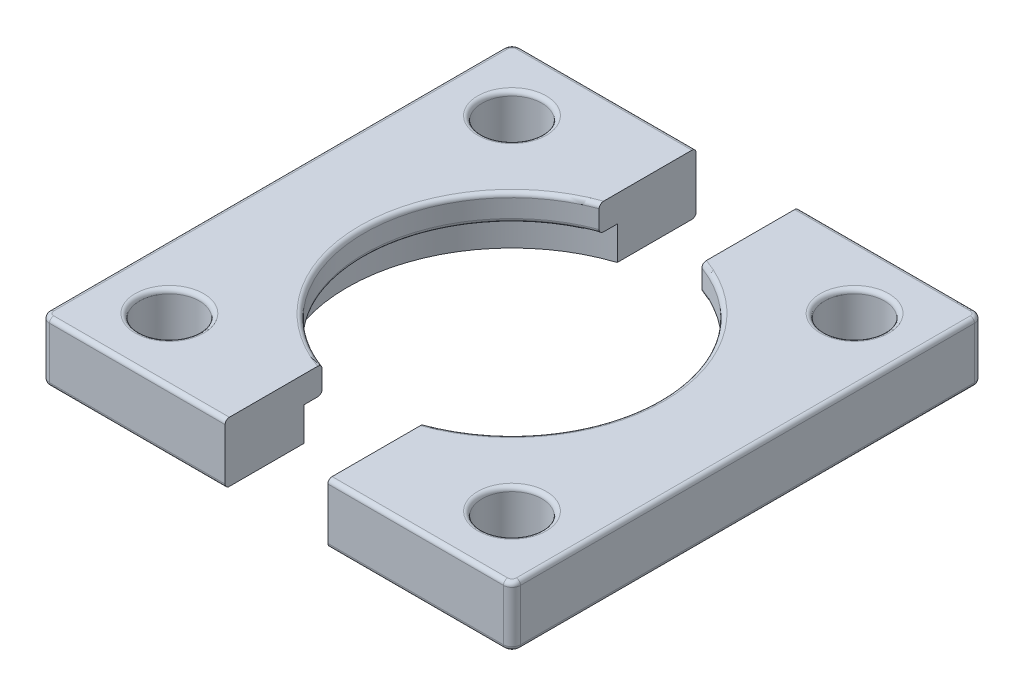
from build123d import *

# Parameters (mm, degrees)
SKETCH1_R             = 3.5
BOSS_EXTRUDE1_DEPTH   = 7
BOSS_EXTRUDE1_2_DEPTH = 7
SKETCH2_R             = 19.25
CUT_EXTRUDE1_DEPTH    = 3.9
FILLET1_R             = 0.5
FILLET2_R             = 0.5


with BuildPart() as part:
    # Sketch1 → Boss-Extrude1 (new body)
    with BuildSketch(Plane(origin=(0, 0, 0), x_dir=(1, 0, 0), z_dir=(0, 1, 0))):
        with BuildLine():
            Line((-6, 27.5), (-6, 16.17289399))
            ThreePointArc((-6, 16.17289399), (-17.25, 0), (-6, -16.17289399))
            Line((-6, -16.17289399), (-6, -27.5))
            Line((-6, -27.5), (-26.5, -27.5))
            ThreePointArc((-26.5, -27.5), (-27.207106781, -27.207106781), (-27.5, -26.5))
            Line((-27.5, -26.5), (-27.5, 26.5))
            ThreePointArc((-27.5, 26.5), (-27.207106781, 27.207106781), (-26.5, 27.5))
            Line((-26.5, 27.5), (-6, 27.5))
        make_face()
        with Locations(Location((-20, 20, 0), (0, 0, 270))):
            Circle(SKETCH1_R, mode=Mode.SUBTRACT)
        with Locations(Location((-20, -20, 0), (0, 0, 90))):
            Circle(SKETCH1_R, mode=Mode.SUBTRACT)
    extrude(amount=BOSS_EXTRUDE1_DEPTH)


with BuildPart() as body_2:
    # Sketch1 → Boss-Extrude1 2 (new body)
    with BuildSketch(Plane(origin=(0, 0, 0), x_dir=(1, 0, 0), z_dir=(0, 1, 0))):
        with BuildLine():
            Line((27.5, 26.5), (27.5, -26.5))
            ThreePointArc((27.5, -26.5), (27.207106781, -27.207106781), (26.5, -27.5))
            Line((26.5, -27.5), (6, -27.5))
            Line((6, -27.5), (6, -16.17289399))
            ThreePointArc((6, -16.17289399), (17.25, 0), (6, 16.17289399))
            Line((6, 16.17289399), (6, 27.5))
            Line((6, 27.5), (26.5, 27.5))
            ThreePointArc((26.5, 27.5), (27.207106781, 27.207106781), (27.5, 26.5))
        make_face()
        with Locations(Location((20, 20, 0), (0, 0, 90))):
            Circle(SKETCH1_R, mode=Mode.SUBTRACT)
        with Locations(Location((20, -20, 0), (0, 0, 270))):
            Circle(SKETCH1_R, mode=Mode.SUBTRACT)
    extrude(amount=BOSS_EXTRUDE1_2_DEPTH)


with BuildPart() as cut_extrude1_tool:
    # Sketch2 → Cut-Extrude1 (new body)
    with BuildSketch(Plane.XZ):
        Circle(SKETCH2_R)
    extrude(amount=-CUT_EXTRUDE1_DEPTH)


with BuildPart() as part_1:
    add(part.part)

    # Cut-Extrude1: cut by cut_extrude1_tool
    add(cut_extrude1_tool.part, mode=Mode.SUBTRACT)

    # Fillet1
    fillet1_edges = [part_1.edges().sort_by_distance(p)[0] for p in [
        (-16.25, 0, 27.5),
        (-27.207106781, 0, 27.207106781),
        (-17.25, 7, 0),
        (-16.25, 7, -27.5),
        (-20, 7, -23.5),
        (-27.207106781, 7, -27.207106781),
        (-20, 7, 23.5),
        (-27.5, 7, 0),
        (-17.25, 3.9, 0),
        (-27.207106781, 7, 27.207106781),
        (-16.25, 7, 27.5),
        (-27.5, 0, 0),
        (-27.207106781, 0, -27.207106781),
        (-16.25, 0, -27.5),
    ]]
    fillet(fillet1_edges, radius=FILLET1_R)


with BuildPart() as body_2_1:
    add(body_2.part)

    # Cut-Extrude1: cut by cut_extrude1_tool
    add(cut_extrude1_tool.part, mode=Mode.SUBTRACT)

    # Fillet2
    fillet2_edges = [body_2_1.edges().sort_by_distance(p)[0] for p in [
        (27.207106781, 7, -27.207106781),
        (27.5, 0, 0),
        (27.207106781, 0, 27.207106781),
        (16.25, 7, -27.5),
        (17.25, 7, 0),
        (20, 7, -16.5),
        (20, 7, 16.5),
        (16.25, 7, 27.5),
        (17.25, 3.9, 0),
        (27.207106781, 7, 27.207106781),
        (27.5, 7, 0),
        (16.25, 0, 27.5),
        (16.25, 0, -27.5),
        (27.207106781, 0, -27.207106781),
    ]]
    fillet(fillet2_edges, radius=FILLET2_R)


solid = Compound([part_1.part, body_2_1.part])
